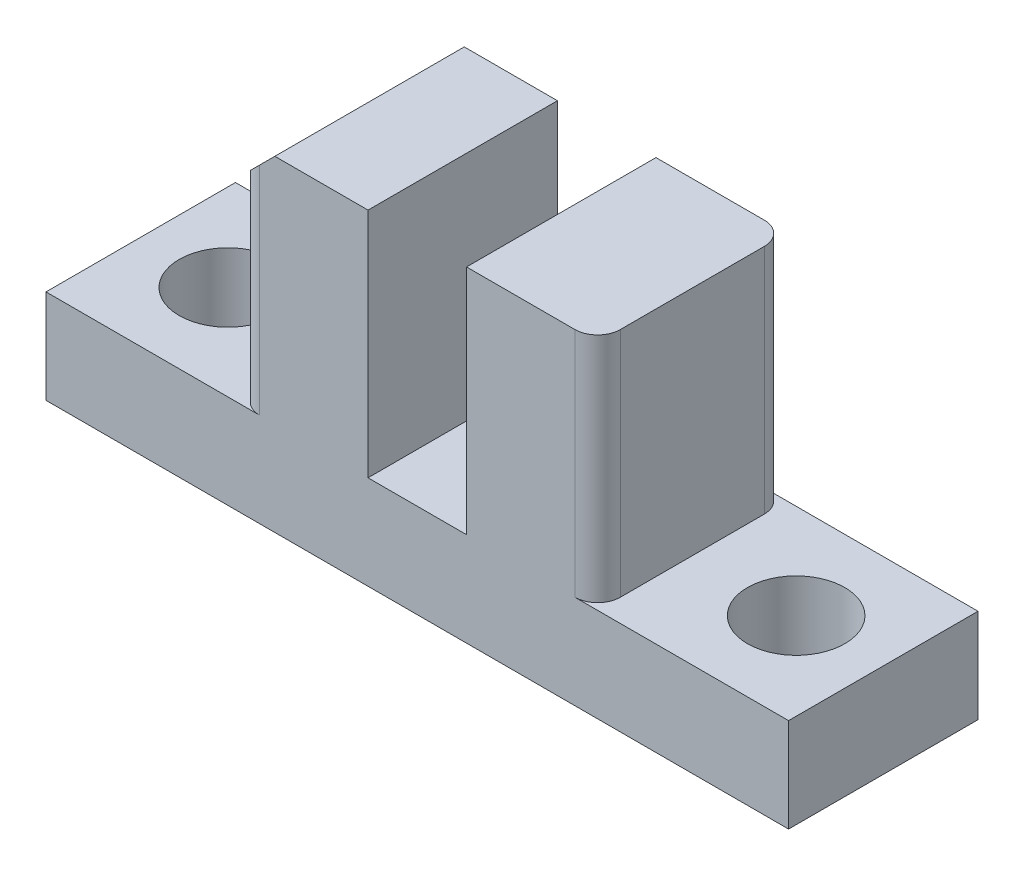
from build123d import *

# Parameters (mm, degrees)
EXTRUDE1_DEPTH                 = 6.35
CHAMFER1_SIZE                  = 1.27
F_30_0_128500_DIAMETER_HOLE1_D = 3.2639
FILLET1_R                      = 0.762


with BuildPart() as part:
    # Sketch1 → Extrude1 (new body)
    with BuildSketch(Plane.XY):
        Polygon((1.651, 10.922), (1.651, 3.1496), (-1.651, 3.1496), (-1.651, 10.922), (-6.0452, 10.922), (-6.0452, 3.1496), (-12.446, 3.1496), (-12.446, 0), (12.446, 0), (12.446, 3.1496), (6.0452, 3.1496), (6.0452, 10.922), align=None)
    extrude(amount=EXTRUDE1_DEPTH)

    # Chamfer1
    chamfer1_edges = [part.edges().sort_by_distance(p)[0] for p in [
        (-6.0452, 10.922, 3.175),
    ]]
    chamfer(chamfer1_edges, length=CHAMFER1_SIZE)

    # 30 _0.128500_ Diameter Hole1 (through all)
    with Locations(Plane(origin=(0, 3.1496, 0), x_dir=(-1, 0, 0), z_dir=(0, 1, 0))):
        with Locations((9.525, 3.175), (-9.525, 3.175)):
            Hole(F_30_0_128500_DIAMETER_HOLE1_D / 2)

    # Fillet1
    fillet1_edges = [part.edges().sort_by_distance(p)[0] for p in [
        (6.0452, 7.0358, 0),
        (6.0452, 7.0358, 6.35),
        (-6.0452, 6.4008, 0),
        (-6.0452, 6.4008, 6.35),
    ]]
    fillet(fillet1_edges, radius=FILLET1_R)


solid = part.part
